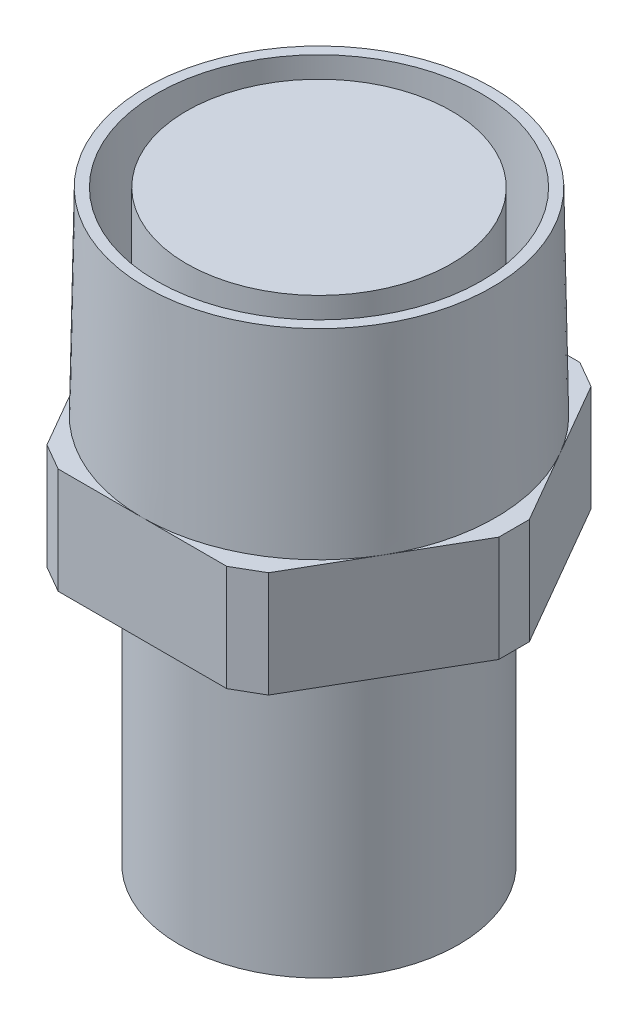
ISO-10303-21;
HEADER;
FILE_DESCRIPTION(('STEP AP214'),'2;1');
FILE_NAME('part.step','',(''),(''),'','','');
FILE_SCHEMA(('AUTOMOTIVE_DESIGN { 1 0 10303 214 1 1 1 1 }'));
ENDSEC;
DATA;
#1=APPLICATION_CONTEXT('core data for automotive mechanical design processes');
#2=APPLICATION_PROTOCOL_DEFINITION('international standard','automotive_design',2000,#1);
#3=PRODUCT_CONTEXT('',#1,'mechanical');
#4=PRODUCT('Part','Part','',(#3));
#5=PRODUCT_RELATED_PRODUCT_CATEGORY('part','',(#4));
#6=PRODUCT_DEFINITION_FORMATION('','',#4);
#7=PRODUCT_DEFINITION_CONTEXT('part definition',#1,'design');
#8=PRODUCT_DEFINITION('design','',#6,#7);
#9=PRODUCT_DEFINITION_SHAPE('','',#8);
#10=(LENGTH_UNIT() NAMED_UNIT(*) SI_UNIT(.MILLI.,.METRE.));
#11=(NAMED_UNIT(*) PLANE_ANGLE_UNIT() SI_UNIT($,.RADIAN.));
#12=(NAMED_UNIT(*) SI_UNIT($,.STERADIAN.) SOLID_ANGLE_UNIT());
#13=UNCERTAINTY_MEASURE_WITH_UNIT(LENGTH_MEASURE(1.E-05),#10,'distance_accuracy_value','');
#14=(GEOMETRIC_REPRESENTATION_CONTEXT(3) GLOBAL_UNCERTAINTY_ASSIGNED_CONTEXT((#13)) GLOBAL_UNIT_ASSIGNED_CONTEXT((#10,
#11,#12)) REPRESENTATION_CONTEXT('',''));
#15=CARTESIAN_POINT('',(0.,0.,0.));
#16=DIRECTION('',(0.,0.,1.));
#17=DIRECTION('',(1.,0.,0.));
#18=AXIS2_PLACEMENT_3D('',#15,#16,#17);
#19=CARTESIAN_POINT('',(5.77350269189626,3.,0.));
#20=DIRECTION('',(0.,1.,0.));
#21=DIRECTION('',(0.,0.,1.));
#22=AXIS2_PLACEMENT_3D('',#19,#20,#21);
#23=PLANE('',#22);
#24=CARTESIAN_POINT('',(0.,3.,0.));
#25=DIRECTION('',(0.,1.,0.));
#26=DIRECTION('',(0.,0.,1.));
#27=AXIS2_PLACEMENT_3D('',#24,#25,#26);
#28=CIRCLE('',#27,4.5);
#29=CARTESIAN_POINT('',(0.,3.,4.5));
#30=VERTEX_POINT('',#29);
#31=EDGE_CURVE('E186',#30,#30,#28,.T.);
#32=ORIENTED_EDGE('',*,*,#31,.T.);
#33=EDGE_LOOP('',(#32));
#34=FACE_BOUND('',#33,.T.);
#35=CARTESIAN_POINT('',(0.,3.,0.));
#36=DIRECTION('',(0.,1.,0.));
#37=DIRECTION('',(0.,0.,1.));
#38=AXIS2_PLACEMENT_3D('',#35,#36,#37);
#39=CIRCLE('',#38,3.75);
#40=CARTESIAN_POINT('',(0.,3.,3.75));
#41=VERTEX_POINT('',#40);
#42=EDGE_CURVE('E551',#41,#41,#39,.T.);
#43=ORIENTED_EDGE('',*,*,#42,.F.);
#44=EDGE_LOOP('',(#43));
#45=FACE_BOUND('',#44,.T.);
#46=ADVANCED_FACE('F38',(#34,#45),#23,.T.);
#47=CARTESIAN_POINT('',(5.77350269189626,0.,0.));
#48=DIRECTION('',(0.,1.,0.));
#49=DIRECTION('',(0.,0.,1.));
#50=AXIS2_PLACEMENT_3D('',#47,#48,#49);
#51=PLANE('',#50);
#52=DIRECTION('',(0.5,0.,-0.866025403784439));
#53=VECTOR('',#52,1.);
#54=CARTESIAN_POINT('',(2.88675134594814,0.,5.));
#55=LINE('',#54,#53);
#56=CARTESIAN_POINT('',(3.13675134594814,0.,4.56698729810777));
#57=VERTEX_POINT('',#56);
#58=CARTESIAN_POINT('',(5.52350269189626,0.,0.433012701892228));
#59=VERTEX_POINT('',#58);
#60=EDGE_CURVE('E190',#57,#59,#55,.T.);
#61=ORIENTED_EDGE('',*,*,#60,.F.);
#62=DIRECTION('',(0.866025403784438,0.,-0.500000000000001));
#63=VECTOR('',#62,1.);
#64=CARTESIAN_POINT('',(3.13675134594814,0.,4.56698729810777));
#65=LINE('',#64,#63);
#66=CARTESIAN_POINT('',(2.38675134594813,0.,5.));
#67=VERTEX_POINT('',#66);
#68=EDGE_CURVE('E239',#57,#67,#65,.F.);
#69=ORIENTED_EDGE('',*,*,#68,.T.);
#70=DIRECTION('',(1.,0.,0.));
#71=VECTOR('',#70,1.);
#72=CARTESIAN_POINT('',(-2.88675134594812,0.,5.));
#73=LINE('',#72,#71);
#74=CARTESIAN_POINT('',(-2.38675134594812,0.,5.));
#75=VERTEX_POINT('',#74);
#76=EDGE_CURVE('E219',#75,#67,#73,.T.);
#77=ORIENTED_EDGE('',*,*,#76,.F.);
#78=DIRECTION('',(0.866025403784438,0.,0.500000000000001));
#79=VECTOR('',#78,1.);
#80=CARTESIAN_POINT('',(-2.38675134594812,0.,5.));
#81=LINE('',#80,#79);
#82=CARTESIAN_POINT('',(-3.13675134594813,0.,4.56698729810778));
#83=VERTEX_POINT('',#82);
#84=EDGE_CURVE('E231',#75,#83,#81,.F.);
#85=ORIENTED_EDGE('',*,*,#84,.T.);
#86=DIRECTION('',(0.5,0.,0.866025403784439));
#87=VECTOR('',#86,1.);
#88=CARTESIAN_POINT('',(-5.77350269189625,0.,0.));
#89=LINE('',#88,#87);
#90=CARTESIAN_POINT('',(-5.52350269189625,0.,0.43301270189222));
#91=VERTEX_POINT('',#90);
#92=EDGE_CURVE('E217',#91,#83,#89,.T.);
#93=ORIENTED_EDGE('',*,*,#92,.F.);
#94=DIRECTION('',(0.,0.,1.));
#95=VECTOR('',#94,1.);
#96=CARTESIAN_POINT('',(-5.52350269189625,0.,0.43301270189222));
#97=LINE('',#96,#95);
#98=CARTESIAN_POINT('',(-5.52350269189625,0.,-0.43301270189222));
#99=VERTEX_POINT('',#98);
#100=EDGE_CURVE('E229',#91,#99,#97,.F.);
#101=ORIENTED_EDGE('',*,*,#100,.T.);
#102=DIRECTION('',(-0.5,0.,0.866025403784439));
#103=VECTOR('',#102,1.);
#104=CARTESIAN_POINT('',(-2.88675134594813,0.,-5.));
#105=LINE('',#104,#103);
#106=CARTESIAN_POINT('',(-3.13675134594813,0.,-4.56698729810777));
#107=VERTEX_POINT('',#106);
#108=EDGE_CURVE('E214',#107,#99,#105,.T.);
#109=ORIENTED_EDGE('',*,*,#108,.F.);
#110=DIRECTION('',(-0.866025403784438,0.,0.500000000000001));
#111=VECTOR('',#110,1.);
#112=CARTESIAN_POINT('',(-3.13675134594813,0.,-4.56698729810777));
#113=LINE('',#112,#111);
#114=CARTESIAN_POINT('',(-2.38675134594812,0.,-5.));
#115=VERTEX_POINT('',#114);
#116=EDGE_CURVE('E233',#107,#115,#113,.F.);
#117=ORIENTED_EDGE('',*,*,#116,.T.);
#118=DIRECTION('',(-1.,0.,0.));
#119=VECTOR('',#118,1.);
#120=CARTESIAN_POINT('',(2.88675134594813,0.,-5.));
#121=LINE('',#120,#119);
#122=CARTESIAN_POINT('',(2.38675134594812,0.,-5.));
#123=VERTEX_POINT('',#122);
#124=EDGE_CURVE('E211',#123,#115,#121,.T.);
#125=ORIENTED_EDGE('',*,*,#124,.F.);
#126=DIRECTION('',(-0.866025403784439,0.,-0.499999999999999));
#127=VECTOR('',#126,1.);
#128=CARTESIAN_POINT('',(2.38675134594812,0.,-5.));
#129=LINE('',#128,#127);
#130=CARTESIAN_POINT('',(3.13675134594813,0.,-4.56698729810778));
#131=VERTEX_POINT('',#130);
#132=EDGE_CURVE('E235',#123,#131,#129,.F.);
#133=ORIENTED_EDGE('',*,*,#132,.T.);
#134=DIRECTION('',(-0.5,0.,-0.866025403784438));
#135=VECTOR('',#134,1.);
#136=CARTESIAN_POINT('',(5.77350269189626,0.,0.));
#137=LINE('',#136,#135);
#138=CARTESIAN_POINT('',(5.52350269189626,0.,-0.43301270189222));
#139=VERTEX_POINT('',#138);
#140=EDGE_CURVE('E208',#139,#131,#137,.T.);
#141=ORIENTED_EDGE('',*,*,#140,.F.);
#142=DIRECTION('',(0.,0.,-1.));
#143=VECTOR('',#142,1.);
#144=CARTESIAN_POINT('',(5.52350269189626,0.,-0.43301270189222));
#145=LINE('',#144,#143);
#146=EDGE_CURVE('E237',#139,#59,#145,.F.);
#147=ORIENTED_EDGE('',*,*,#146,.T.);
#148=EDGE_LOOP('',(#61,#69,#77,#85,#93,#101,#109,#117,#125,#133,#141,#147));
#149=FACE_BOUND('',#148,.T.);
#150=CARTESIAN_POINT('',(0.,0.,0.));
#151=DIRECTION('',(0.,1.,0.));
#152=DIRECTION('',(0.,0.,1.));
#153=AXIS2_PLACEMENT_3D('',#150,#151,#152);
#154=CIRCLE('',#153,3.95);
#155=CARTESIAN_POINT('',(0.,0.,3.95));
#156=VERTEX_POINT('',#155);
#157=EDGE_CURVE('E221',#156,#156,#154,.F.);
#158=ORIENTED_EDGE('',*,*,#157,.F.);
#159=EDGE_LOOP('',(#158));
#160=FACE_BOUND('',#159,.T.);
#161=ADVANCED_FACE('F276',(#149,#160),#51,.F.);
#162=DIRECTION('',(1.,0.,0.));
#163=VECTOR('',#162,1.);
#164=CARTESIAN_POINT('',(-2.88675134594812,3.,5.));
#165=LINE('',#164,#163);
#166=CARTESIAN_POINT('',(0.,3.,5.));
#167=VERTEX_POINT('',#166);
#168=CARTESIAN_POINT('',(2.38675134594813,3.,5.));
#169=VERTEX_POINT('',#168);
#170=EDGE_CURVE('E155',#167,#169,#165,.T.);
#171=ORIENTED_EDGE('',*,*,#170,.T.);
#172=DIRECTION('',(-0.866025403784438,0.,0.500000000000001));
#173=VECTOR('',#172,1.);
#174=CARTESIAN_POINT('',(7.09187836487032,3.,2.28349364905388));
#175=LINE('',#174,#173);
#176=CARTESIAN_POINT('',(3.13675134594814,3.,4.56698729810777));
#177=VERTEX_POINT('',#176);
#178=EDGE_CURVE('E244',#169,#177,#175,.F.);
#179=ORIENTED_EDGE('',*,*,#178,.T.);
#180=DIRECTION('',(0.5,0.,-0.866025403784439));
#181=VECTOR('',#180,1.);
#182=CARTESIAN_POINT('',(2.88675134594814,3.,5.));
#183=LINE('',#182,#181);
#184=CARTESIAN_POINT('',(4.3301270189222,3.,2.5));
#185=VERTEX_POINT('',#184);
#186=EDGE_CURVE('E170',#177,#185,#183,.T.);
#187=ORIENTED_EDGE('',*,*,#186,.T.);
#188=CARTESIAN_POINT('',(0.,3.,0.));
#189=DIRECTION('',(0.,1.,0.));
#190=DIRECTION('',(0.,0.,1.));
#191=AXIS2_PLACEMENT_3D('',#188,#189,#190);
#192=CIRCLE('',#191,5.);
#193=EDGE_CURVE('E167',#167,#185,#192,.T.);
#194=ORIENTED_EDGE('',*,*,#193,.F.);
#195=EDGE_LOOP('',(#171,#179,#187,#194));
#196=FACE_BOUND('',#195,.T.);
#197=ADVANCED_FACE('F168',(#196),#23,.T.);
#198=CARTESIAN_POINT('',(5.52350269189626,3.,0.433012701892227));
#199=VERTEX_POINT('',#198);
#200=EDGE_CURVE('E195',#185,#199,#183,.T.);
#201=ORIENTED_EDGE('',*,*,#200,.T.);
#202=DIRECTION('',(0.,0.,1.));
#203=VECTOR('',#202,1.);
#204=CARTESIAN_POINT('',(5.52350269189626,3.,0.));
#205=LINE('',#204,#203);
#206=CARTESIAN_POINT('',(5.52350269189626,3.,-0.43301270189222));
#207=VERTEX_POINT('',#206);
#208=EDGE_CURVE('E251',#199,#207,#205,.F.);
#209=ORIENTED_EDGE('',*,*,#208,.T.);
#210=DIRECTION('',(-0.5,0.,-0.866025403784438));
#211=VECTOR('',#210,1.);
#212=CARTESIAN_POINT('',(5.77350269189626,3.,0.));
#213=LINE('',#212,#211);
#214=CARTESIAN_POINT('',(4.33012701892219,3.,-2.5));
#215=VERTEX_POINT('',#214);
#216=EDGE_CURVE('E196',#207,#215,#213,.T.);
#217=ORIENTED_EDGE('',*,*,#216,.T.);
#218=EDGE_CURVE('E177',#185,#215,#192,.T.);
#219=ORIENTED_EDGE('',*,*,#218,.F.);
#220=EDGE_LOOP('',(#201,#209,#217,#219));
#221=FACE_BOUND('',#220,.T.);
#222=ADVANCED_FACE('F292',(#221),#23,.T.);
#223=CARTESIAN_POINT('',(3.13675134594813,3.,-4.56698729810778));
#224=VERTEX_POINT('',#223);
#225=EDGE_CURVE('E194',#215,#224,#213,.T.);
#226=ORIENTED_EDGE('',*,*,#225,.T.);
#227=DIRECTION('',(0.866025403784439,0.,0.499999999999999));
#228=VECTOR('',#227,1.);
#229=CARTESIAN_POINT('',(7.09187836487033,3.,-2.28349364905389));
#230=LINE('',#229,#228);
#231=CARTESIAN_POINT('',(2.38675134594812,3.,-5.));
#232=VERTEX_POINT('',#231);
#233=EDGE_CURVE('E258',#224,#232,#230,.F.);
#234=ORIENTED_EDGE('',*,*,#233,.T.);
#235=DIRECTION('',(-1.,0.,0.));
#236=VECTOR('',#235,1.);
#237=CARTESIAN_POINT('',(2.88675134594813,3.,-5.));
#238=LINE('',#237,#236);
#239=CARTESIAN_POINT('',(0.,3.,-5.));
#240=VERTEX_POINT('',#239);
#241=EDGE_CURVE('E199',#232,#240,#238,.T.);
#242=ORIENTED_EDGE('',*,*,#241,.T.);
#243=EDGE_CURVE('E319',#215,#240,#192,.T.);
#244=ORIENTED_EDGE('',*,*,#243,.F.);
#245=EDGE_LOOP('',(#226,#234,#242,#244));
#246=FACE_BOUND('',#245,.T.);
#247=ADVANCED_FACE('F318',(#246),#23,.T.);
#248=CARTESIAN_POINT('',(-2.38675134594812,3.,-5.));
#249=VERTEX_POINT('',#248);
#250=EDGE_CURVE('E198',#240,#249,#238,.T.);
#251=ORIENTED_EDGE('',*,*,#250,.T.);
#252=DIRECTION('',(0.866025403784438,0.,-0.500000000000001));
#253=VECTOR('',#252,1.);
#254=CARTESIAN_POINT('',(1.56837567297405,3.,-7.28349364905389));
#255=LINE('',#254,#253);
#256=CARTESIAN_POINT('',(-3.13675134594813,3.,-4.56698729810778));
#257=VERTEX_POINT('',#256);
#258=EDGE_CURVE('E265',#249,#257,#255,.F.);
#259=ORIENTED_EDGE('',*,*,#258,.T.);
#260=DIRECTION('',(-0.5,0.,0.866025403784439));
#261=VECTOR('',#260,1.);
#262=CARTESIAN_POINT('',(-2.88675134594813,3.,-5.));
#263=LINE('',#262,#261);
#264=CARTESIAN_POINT('',(-4.33012701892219,3.,-2.5));
#265=VERTEX_POINT('',#264);
#266=EDGE_CURVE('E202',#257,#265,#263,.T.);
#267=ORIENTED_EDGE('',*,*,#266,.T.);
#268=EDGE_CURVE('E183',#240,#265,#192,.T.);
#269=ORIENTED_EDGE('',*,*,#268,.F.);
#270=EDGE_LOOP('',(#251,#259,#267,#269));
#271=FACE_BOUND('',#270,.T.);
#272=ADVANCED_FACE('F321',(#271),#23,.T.);
#273=CARTESIAN_POINT('',(-5.52350269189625,3.,-0.433012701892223));
#274=VERTEX_POINT('',#273);
#275=EDGE_CURVE('E201',#265,#274,#263,.T.);
#276=ORIENTED_EDGE('',*,*,#275,.T.);
#277=DIRECTION('',(0.,0.,-1.));
#278=VECTOR('',#277,1.);
#279=CARTESIAN_POINT('',(-5.52350269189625,3.,0.));
#280=LINE('',#279,#278);
#281=CARTESIAN_POINT('',(-5.52350269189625,3.,0.433012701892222));
#282=VERTEX_POINT('',#281);
#283=EDGE_CURVE('E11',#274,#282,#280,.F.);
#284=ORIENTED_EDGE('',*,*,#283,.T.);
#285=DIRECTION('',(0.5,0.,0.866025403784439));
#286=VECTOR('',#285,1.);
#287=CARTESIAN_POINT('',(-5.77350269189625,3.,0.));
#288=LINE('',#287,#286);
#289=CARTESIAN_POINT('',(-4.33012701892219,3.,2.5));
#290=VERTEX_POINT('',#289);
#291=EDGE_CURVE('E165',#282,#290,#288,.T.);
#292=ORIENTED_EDGE('',*,*,#291,.T.);
#293=EDGE_CURVE('E182',#265,#290,#192,.T.);
#294=ORIENTED_EDGE('',*,*,#293,.F.);
#295=EDGE_LOOP('',(#276,#284,#292,#294));
#296=FACE_BOUND('',#295,.T.);
#297=ADVANCED_FACE('F327',(#296),#23,.T.);
#298=CARTESIAN_POINT('',(2.88675134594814,3.,5.));
#299=DIRECTION('',(-0.866025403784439,0.,-0.5));
#300=DIRECTION('',(-0.5,0.,0.866025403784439));
#301=AXIS2_PLACEMENT_3D('',#298,#299,#300);
#302=PLANE('',#301);
#303=ORIENTED_EDGE('',*,*,#186,.F.);
#304=DIRECTION('',(0.,-1.,0.));
#305=VECTOR('',#304,1.);
#306=CARTESIAN_POINT('',(3.13675134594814,3.,4.56698729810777));
#307=LINE('',#306,#305);
#308=EDGE_CURVE('E226',#177,#57,#307,.T.);
#309=ORIENTED_EDGE('',*,*,#308,.T.);
#310=ORIENTED_EDGE('',*,*,#60,.T.);
#311=DIRECTION('',(0.,1.,0.));
#312=VECTOR('',#311,1.);
#313=CARTESIAN_POINT('',(5.52350269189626,3.,0.433012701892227));
#314=LINE('',#313,#312);
#315=EDGE_CURVE('E224',#59,#199,#314,.T.);
#316=ORIENTED_EDGE('',*,*,#315,.T.);
#317=ORIENTED_EDGE('',*,*,#200,.F.);
#318=EDGE_LOOP('',(#303,#309,#310,#316,#317));
#319=FACE_BOUND('',#318,.T.);
#320=ADVANCED_FACE('F287',(#319),#302,.F.);
#321=CARTESIAN_POINT('',(5.77350269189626,3.,0.));
#322=DIRECTION('',(-0.866025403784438,0.,0.500000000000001));
#323=DIRECTION('',(0.500000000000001,0.,0.866025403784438));
#324=AXIS2_PLACEMENT_3D('',#321,#322,#323);
#325=PLANE('',#324);
#326=ORIENTED_EDGE('',*,*,#216,.F.);
#327=DIRECTION('',(0.,-1.,0.));
#328=VECTOR('',#327,1.);
#329=CARTESIAN_POINT('',(5.52350269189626,3.,-0.43301270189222));
#330=LINE('',#329,#328);
#331=EDGE_CURVE('E248',#207,#139,#330,.T.);
#332=ORIENTED_EDGE('',*,*,#331,.T.);
#333=ORIENTED_EDGE('',*,*,#140,.T.);
#334=DIRECTION('',(0.,1.,0.));
#335=VECTOR('',#334,1.);
#336=CARTESIAN_POINT('',(3.13675134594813,3.,-4.56698729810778));
#337=LINE('',#336,#335);
#338=EDGE_CURVE('E246',#131,#224,#337,.T.);
#339=ORIENTED_EDGE('',*,*,#338,.T.);
#340=ORIENTED_EDGE('',*,*,#225,.F.);
#341=EDGE_LOOP('',(#326,#332,#333,#339,#340));
#342=FACE_BOUND('',#341,.T.);
#343=ADVANCED_FACE('F299',(#342),#325,.F.);
#344=CARTESIAN_POINT('',(2.88675134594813,3.,-5.));
#345=DIRECTION('',(0.,0.,1.));
#346=DIRECTION('',(1.,0.,0.));
#347=AXIS2_PLACEMENT_3D('',#344,#345,#346);
#348=PLANE('',#347);
#349=ORIENTED_EDGE('',*,*,#241,.F.);
#350=DIRECTION('',(0.,-1.,0.));
#351=VECTOR('',#350,1.);
#352=CARTESIAN_POINT('',(2.38675134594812,3.,-5.));
#353=LINE('',#352,#351);
#354=EDGE_CURVE('E255',#232,#123,#353,.T.);
#355=ORIENTED_EDGE('',*,*,#354,.T.);
#356=ORIENTED_EDGE('',*,*,#124,.T.);
#357=DIRECTION('',(0.,1.,0.));
#358=VECTOR('',#357,1.);
#359=CARTESIAN_POINT('',(-2.38675134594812,3.,-5.));
#360=LINE('',#359,#358);
#361=EDGE_CURVE('E253',#115,#249,#360,.T.);
#362=ORIENTED_EDGE('',*,*,#361,.T.);
#363=ORIENTED_EDGE('',*,*,#250,.F.);
#364=EDGE_LOOP('',(#349,#355,#356,#362,#363));
#365=FACE_BOUND('',#364,.T.);
#366=ADVANCED_FACE('F309',(#365),#348,.F.);
#367=CARTESIAN_POINT('',(-2.88675134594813,3.,-5.));
#368=DIRECTION('',(0.866025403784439,0.,0.5));
#369=DIRECTION('',(0.5,0.,-0.866025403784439));
#370=AXIS2_PLACEMENT_3D('',#367,#368,#369);
#371=PLANE('',#370);
#372=ORIENTED_EDGE('',*,*,#266,.F.);
#373=DIRECTION('',(0.,-1.,0.));
#374=VECTOR('',#373,1.);
#375=CARTESIAN_POINT('',(-3.13675134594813,3.,-4.56698729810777));
#376=LINE('',#375,#374);
#377=EDGE_CURVE('E262',#257,#107,#376,.T.);
#378=ORIENTED_EDGE('',*,*,#377,.T.);
#379=ORIENTED_EDGE('',*,*,#108,.T.);
#380=DIRECTION('',(0.,1.,0.));
#381=VECTOR('',#380,1.);
#382=CARTESIAN_POINT('',(-5.52350269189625,3.,-0.433012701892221));
#383=LINE('',#382,#381);
#384=EDGE_CURVE('E260',#99,#274,#383,.T.);
#385=ORIENTED_EDGE('',*,*,#384,.T.);
#386=ORIENTED_EDGE('',*,*,#275,.F.);
#387=EDGE_LOOP('',(#372,#378,#379,#385,#386));
#388=FACE_BOUND('',#387,.T.);
#389=ADVANCED_FACE('F328',(#388),#371,.F.);
#390=CARTESIAN_POINT('',(-5.77350269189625,3.,0.));
#391=DIRECTION('',(0.866025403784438,0.,-0.5));
#392=DIRECTION('',(-0.5,0.,-0.866025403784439));
#393=AXIS2_PLACEMENT_3D('',#390,#391,#392);
#394=PLANE('',#393);
#395=ORIENTED_EDGE('',*,*,#92,.T.);
#396=DIRECTION('',(0.,1.,0.));
#397=VECTOR('',#396,1.);
#398=CARTESIAN_POINT('',(-3.13675134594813,3.,4.56698729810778));
#399=LINE('',#398,#397);
#400=CARTESIAN_POINT('',(-3.13675134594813,3.,4.56698729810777));
#401=VERTEX_POINT('',#400);
#402=EDGE_CURVE('E59',#83,#401,#399,.T.);
#403=ORIENTED_EDGE('',*,*,#402,.T.);
#404=EDGE_CURVE('E204',#290,#401,#288,.T.);
#405=ORIENTED_EDGE('',*,*,#404,.F.);
#406=ORIENTED_EDGE('',*,*,#291,.F.);
#407=DIRECTION('',(0.,-1.,0.));
#408=VECTOR('',#407,1.);
#409=CARTESIAN_POINT('',(-5.52350269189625,3.,0.43301270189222));
#410=LINE('',#409,#408);
#411=EDGE_CURVE('E267',#282,#91,#410,.T.);
#412=ORIENTED_EDGE('',*,*,#411,.T.);
#413=EDGE_LOOP('',(#395,#403,#405,#406,#412));
#414=FACE_BOUND('',#413,.T.);
#415=ADVANCED_FACE('F272',(#414),#394,.F.);
#416=CARTESIAN_POINT('',(-2.88675134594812,3.,5.));
#417=DIRECTION('',(0.,0.,-1.));
#418=DIRECTION('',(-1.,0.,0.));
#419=AXIS2_PLACEMENT_3D('',#416,#417,#418);
#420=PLANE('',#419);
#421=ORIENTED_EDGE('',*,*,#76,.T.);
#422=DIRECTION('',(0.,1.,0.));
#423=VECTOR('',#422,1.);
#424=CARTESIAN_POINT('',(2.38675134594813,3.,5.));
#425=LINE('',#424,#423);
#426=EDGE_CURVE('E162',#67,#169,#425,.T.);
#427=ORIENTED_EDGE('',*,*,#426,.T.);
#428=ORIENTED_EDGE('',*,*,#170,.F.);
#429=CARTESIAN_POINT('',(-2.38675134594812,3.,5.));
#430=VERTEX_POINT('',#429);
#431=EDGE_CURVE('E146',#430,#167,#165,.T.);
#432=ORIENTED_EDGE('',*,*,#431,.F.);
#433=DIRECTION('',(0.,-1.,0.));
#434=VECTOR('',#433,1.);
#435=CARTESIAN_POINT('',(-2.38675134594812,3.,5.));
#436=LINE('',#435,#434);
#437=EDGE_CURVE('E241',#430,#75,#436,.T.);
#438=ORIENTED_EDGE('',*,*,#437,.T.);
#439=EDGE_LOOP('',(#421,#427,#428,#432,#438));
#440=FACE_BOUND('',#439,.T.);
#441=ADVANCED_FACE('F160',(#440),#420,.F.);
#442=ORIENTED_EDGE('',*,*,#404,.T.);
#443=DIRECTION('',(-0.866025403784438,0.,-0.500000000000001));
#444=VECTOR('',#443,1.);
#445=CARTESIAN_POINT('',(1.56837567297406,3.,7.28349364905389));
#446=LINE('',#445,#444);
#447=EDGE_CURVE('E46',#401,#430,#446,.F.);
#448=ORIENTED_EDGE('',*,*,#447,.T.);
#449=ORIENTED_EDGE('',*,*,#431,.T.);
#450=EDGE_CURVE('E150',#290,#167,#192,.T.);
#451=ORIENTED_EDGE('',*,*,#450,.F.);
#452=EDGE_LOOP('',(#442,#448,#449,#451));
#453=FACE_BOUND('',#452,.T.);
#454=ADVANCED_FACE('F148',(#453),#23,.T.);
#455=CARTESIAN_POINT('',(0.,8.6,0.));
#456=DIRECTION('',(0.,1.,0.));
#457=DIRECTION('',(0.,0.,1.));
#458=AXIS2_PLACEMENT_3D('',#455,#456,#457);
#459=PLANE('',#458);
#460=CARTESIAN_POINT('',(0.,8.6,0.));
#461=DIRECTION('',(0.,1.,0.));
#462=DIRECTION('',(0.,0.,1.));
#463=AXIS2_PLACEMENT_3D('',#460,#461,#462);
#464=CIRCLE('',#463,4.90225163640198);
#465=CARTESIAN_POINT('',(0.,8.6,4.90225163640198));
#466=VERTEX_POINT('',#465);
#467=EDGE_CURVE('E174',#466,#466,#464,.T.);
#468=ORIENTED_EDGE('',*,*,#467,.T.);
#469=EDGE_LOOP('',(#468));
#470=FACE_BOUND('',#469,.T.);
#471=CARTESIAN_POINT('',(0.,8.6,0.));
#472=DIRECTION('',(0.,1.,0.));
#473=DIRECTION('',(0.,0.,1.));
#474=AXIS2_PLACEMENT_3D('',#471,#472,#473);
#475=CIRCLE('',#474,4.59774836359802);
#476=CARTESIAN_POINT('',(0.,8.6,4.59774836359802));
#477=VERTEX_POINT('',#476);
#478=EDGE_CURVE('E175',#477,#477,#475,.T.);
#479=ORIENTED_EDGE('',*,*,#478,.F.);
#480=EDGE_LOOP('',(#479));
#481=FACE_BOUND('',#480,.T.);
#482=ADVANCED_FACE('F351',(#470,#481),#459,.T.);
#483=CARTESIAN_POINT('',(0.,3.,0.));
#484=DIRECTION('',(0.,-1.,0.));
#485=DIRECTION('',(0.,0.,1.));
#486=AXIS2_PLACEMENT_3D('',#483,#484,#485);
#487=CONICAL_SURFACE('',#486,5.,0.0174532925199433);
#488=ORIENTED_EDGE('',*,*,#467,.F.);
#489=EDGE_LOOP('',(#488));
#490=FACE_BOUND('',#489,.T.);
#491=ORIENTED_EDGE('',*,*,#193,.T.);
#492=ORIENTED_EDGE('',*,*,#218,.T.);
#493=ORIENTED_EDGE('',*,*,#243,.T.);
#494=ORIENTED_EDGE('',*,*,#268,.T.);
#495=ORIENTED_EDGE('',*,*,#293,.T.);
#496=ORIENTED_EDGE('',*,*,#450,.T.);
#497=EDGE_LOOP('',(#491,#492,#493,#494,#495,#496));
#498=FACE_BOUND('',#497,.T.);
#499=ADVANCED_FACE('F179',(#490,#498),#487,.T.);
#500=CARTESIAN_POINT('',(0.,3.,0.));
#501=DIRECTION('',(0.,1.,0.));
#502=DIRECTION('',(0.,0.,1.));
#503=AXIS2_PLACEMENT_3D('',#500,#501,#502);
#504=CONICAL_SURFACE('',#503,4.5,0.0174532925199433);
#505=ORIENTED_EDGE('',*,*,#478,.T.);
#506=EDGE_LOOP('',(#505));
#507=FACE_BOUND('',#506,.T.);
#508=ORIENTED_EDGE('',*,*,#31,.F.);
#509=EDGE_LOOP('',(#508));
#510=FACE_BOUND('',#509,.T.);
#511=ADVANCED_FACE('F404',(#507,#510),#504,.F.);
#512=CARTESIAN_POINT('',(0.,-8.,0.));
#513=DIRECTION('',(0.,1.,0.));
#514=DIRECTION('',(0.,0.,1.));
#515=AXIS2_PLACEMENT_3D('',#512,#513,#514);
#516=CYLINDRICAL_SURFACE('',#515,3.95);
#517=CARTESIAN_POINT('',(0.,-8.,0.));
#518=DIRECTION('',(0.,-1.,0.));
#519=DIRECTION('',(0.,0.,-1.));
#520=AXIS2_PLACEMENT_3D('',#517,#518,#519);
#521=CIRCLE('',#520,3.95);
#522=CARTESIAN_POINT('',(0.,-8.,-3.95));
#523=VERTEX_POINT('',#522);
#524=EDGE_CURVE('E550',#523,#523,#521,.T.);
#525=ORIENTED_EDGE('',*,*,#524,.F.);
#526=EDGE_LOOP('',(#525));
#527=FACE_BOUND('',#526,.T.);
#528=ORIENTED_EDGE('',*,*,#157,.T.);
#529=EDGE_LOOP('',(#528));
#530=FACE_BOUND('',#529,.T.);
#531=ADVANCED_FACE('F393',(#527,#530),#516,.T.);
#532=CARTESIAN_POINT('',(0.,-8.,0.));
#533=DIRECTION('',(0.,-1.,0.));
#534=DIRECTION('',(0.,0.,-1.));
#535=AXIS2_PLACEMENT_3D('',#532,#533,#534);
#536=PLANE('',#535);
#537=ORIENTED_EDGE('',*,*,#524,.T.);
#538=EDGE_LOOP('',(#537));
#539=FACE_BOUND('',#538,.T.);
#540=ADVANCED_FACE('F388',(#539),#536,.T.);
#541=CARTESIAN_POINT('',(3.13675134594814,3.,4.56698729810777));
#542=DIRECTION('',(-0.500000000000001,0.,-0.866025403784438));
#543=DIRECTION('',(-0.866025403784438,0.,0.500000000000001));
#544=AXIS2_PLACEMENT_3D('',#541,#542,#543);
#545=PLANE('',#544);
#546=ORIENTED_EDGE('',*,*,#178,.F.);
#547=ORIENTED_EDGE('',*,*,#426,.F.);
#548=ORIENTED_EDGE('',*,*,#68,.F.);
#549=ORIENTED_EDGE('',*,*,#308,.F.);
#550=EDGE_LOOP('',(#546,#547,#548,#549));
#551=FACE_BOUND('',#550,.T.);
#552=ADVANCED_FACE('F283',(#551),#545,.F.);
#553=CARTESIAN_POINT('',(5.52350269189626,3.,-0.43301270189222));
#554=DIRECTION('',(-1.,0.,0.));
#555=DIRECTION('',(0.,0.,1.));
#556=AXIS2_PLACEMENT_3D('',#553,#554,#555);
#557=PLANE('',#556);
#558=ORIENTED_EDGE('',*,*,#208,.F.);
#559=ORIENTED_EDGE('',*,*,#315,.F.);
#560=ORIENTED_EDGE('',*,*,#146,.F.);
#561=ORIENTED_EDGE('',*,*,#331,.F.);
#562=EDGE_LOOP('',(#558,#559,#560,#561));
#563=FACE_BOUND('',#562,.T.);
#564=ADVANCED_FACE('F296',(#563),#557,.F.);
#565=CARTESIAN_POINT('',(2.38675134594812,3.,-5.));
#566=DIRECTION('',(-0.499999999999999,0.,0.866025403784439));
#567=DIRECTION('',(0.866025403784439,0.,0.499999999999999));
#568=AXIS2_PLACEMENT_3D('',#565,#566,#567);
#569=PLANE('',#568);
#570=ORIENTED_EDGE('',*,*,#233,.F.);
#571=ORIENTED_EDGE('',*,*,#338,.F.);
#572=ORIENTED_EDGE('',*,*,#132,.F.);
#573=ORIENTED_EDGE('',*,*,#354,.F.);
#574=EDGE_LOOP('',(#570,#571,#572,#573));
#575=FACE_BOUND('',#574,.T.);
#576=ADVANCED_FACE('F306',(#575),#569,.F.);
#577=CARTESIAN_POINT('',(-3.13675134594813,3.,-4.56698729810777));
#578=DIRECTION('',(0.500000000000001,0.,0.866025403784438));
#579=DIRECTION('',(0.866025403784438,0.,-0.500000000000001));
#580=AXIS2_PLACEMENT_3D('',#577,#578,#579);
#581=PLANE('',#580);
#582=ORIENTED_EDGE('',*,*,#258,.F.);
#583=ORIENTED_EDGE('',*,*,#361,.F.);
#584=ORIENTED_EDGE('',*,*,#116,.F.);
#585=ORIENTED_EDGE('',*,*,#377,.F.);
#586=EDGE_LOOP('',(#582,#583,#584,#585));
#587=FACE_BOUND('',#586,.T.);
#588=ADVANCED_FACE('F339',(#587),#581,.F.);
#589=CARTESIAN_POINT('',(-2.38675134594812,3.,5.));
#590=DIRECTION('',(0.500000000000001,0.,-0.866025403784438));
#591=DIRECTION('',(-0.866025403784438,0.,-0.500000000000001));
#592=AXIS2_PLACEMENT_3D('',#589,#590,#591);
#593=PLANE('',#592);
#594=ORIENTED_EDGE('',*,*,#447,.F.);
#595=ORIENTED_EDGE('',*,*,#402,.F.);
#596=ORIENTED_EDGE('',*,*,#84,.F.);
#597=ORIENTED_EDGE('',*,*,#437,.F.);
#598=EDGE_LOOP('',(#594,#595,#596,#597));
#599=FACE_BOUND('',#598,.T.);
#600=ADVANCED_FACE('F281',(#599),#593,.F.);
#601=CARTESIAN_POINT('',(-5.52350269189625,3.,0.43301270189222));
#602=DIRECTION('',(1.,0.,0.));
#603=DIRECTION('',(0.,0.,-1.));
#604=AXIS2_PLACEMENT_3D('',#601,#602,#603);
#605=PLANE('',#604);
#606=ORIENTED_EDGE('',*,*,#283,.F.);
#607=ORIENTED_EDGE('',*,*,#384,.F.);
#608=ORIENTED_EDGE('',*,*,#100,.F.);
#609=ORIENTED_EDGE('',*,*,#411,.F.);
#610=EDGE_LOOP('',(#606,#607,#608,#609));
#611=FACE_BOUND('',#610,.T.);
#612=ADVANCED_FACE('F40',(#611),#605,.F.);
#613=CARTESIAN_POINT('',(0.,19.2066017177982,0.));
#614=DIRECTION('',(0.,-1.,0.));
#615=DIRECTION('',(0.,0.,-1.));
#616=AXIS2_PLACEMENT_3D('',#613,#614,#615);
#617=CYLINDRICAL_SURFACE('',#616,3.75);
#618=ORIENTED_EDGE('',*,*,#42,.T.);
#619=EDGE_LOOP('',(#618));
#620=FACE_BOUND('',#619,.T.);
#621=CARTESIAN_POINT('',(0.,8.6,0.));
#622=DIRECTION('',(0.,1.,0.));
#623=DIRECTION('',(0.,0.,1.));
#624=AXIS2_PLACEMENT_3D('',#621,#622,#623);
#625=CIRCLE('',#624,3.75);
#626=CARTESIAN_POINT('',(0.,8.6,3.75));
#627=VERTEX_POINT('',#626);
#628=EDGE_CURVE('E548',#627,#627,#625,.T.);
#629=ORIENTED_EDGE('',*,*,#628,.F.);
#630=EDGE_LOOP('',(#629));
#631=FACE_BOUND('',#630,.T.);
#632=ADVANCED_FACE('F331',(#620,#631),#617,.T.);
#633=CARTESIAN_POINT('',(0.,8.6,0.));
#634=DIRECTION('',(0.,1.,0.));
#635=DIRECTION('',(0.,0.,1.));
#636=AXIS2_PLACEMENT_3D('',#633,#634,#635);
#637=PLANE('',#636);
#638=ORIENTED_EDGE('',*,*,#628,.T.);
#639=EDGE_LOOP('',(#638));
#640=FACE_BOUND('',#639,.T.);
#641=ADVANCED_FACE('F336',(#640),#637,.T.);
#642=CLOSED_SHELL('',(#46,#161,#197,#222,#247,#272,#297,#320,#343,#366,#389,#415,#441,#454,#482,
#499,#511,#531,#540,#552,#564,#576,#588,#600,#612,#632,#641));
#643=MANIFOLD_SOLID_BREP('B2',#642);
#644=ADVANCED_BREP_SHAPE_REPRESENTATION('',(#18,#643),#14);
#645=SHAPE_DEFINITION_REPRESENTATION(#9,#644);
ENDSEC;
END-ISO-10303-21;
